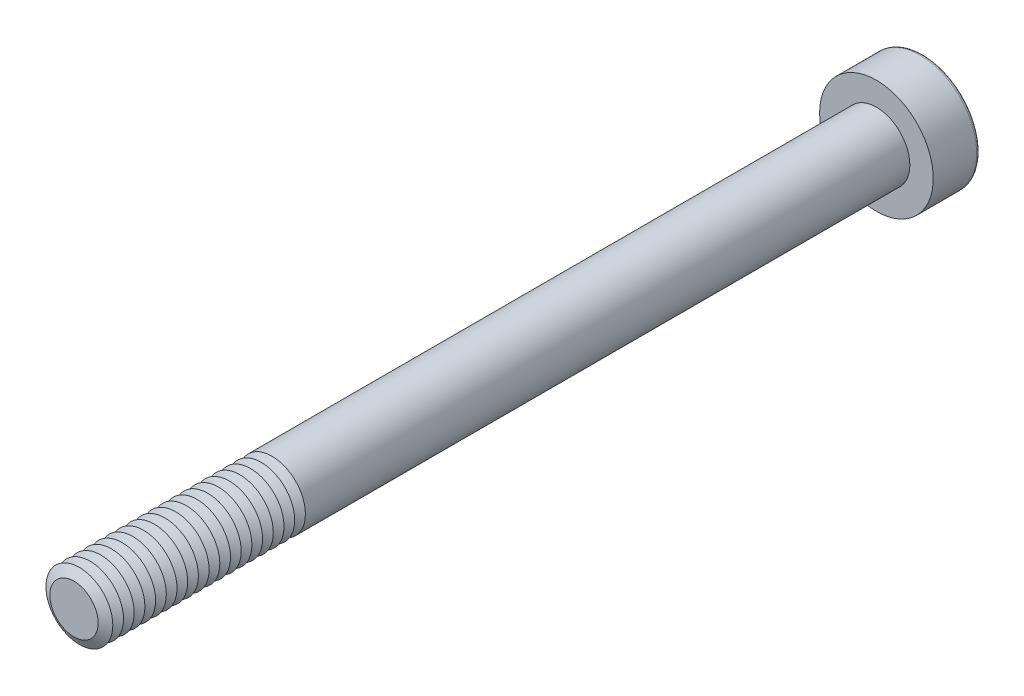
ISO-10303-21;
HEADER;
FILE_DESCRIPTION(('STEP AP214'),'2;1');
FILE_NAME('part.step','',(''),(''),'','','');
FILE_SCHEMA(('AUTOMOTIVE_DESIGN { 1 0 10303 214 1 1 1 1 }'));
ENDSEC;
DATA;
#1=APPLICATION_CONTEXT('core data for automotive mechanical design processes');
#2=APPLICATION_PROTOCOL_DEFINITION('international standard','automotive_design',2000,#1);
#3=PRODUCT_CONTEXT('',#1,'mechanical');
#4=PRODUCT('Part','Part','',(#3));
#5=PRODUCT_RELATED_PRODUCT_CATEGORY('part','',(#4));
#6=PRODUCT_DEFINITION_FORMATION('','',#4);
#7=PRODUCT_DEFINITION_CONTEXT('part definition',#1,'design');
#8=PRODUCT_DEFINITION('design','',#6,#7);
#9=PRODUCT_DEFINITION_SHAPE('','',#8);
#10=(LENGTH_UNIT() NAMED_UNIT(*) SI_UNIT(.MILLI.,.METRE.));
#11=(NAMED_UNIT(*) PLANE_ANGLE_UNIT() SI_UNIT($,.RADIAN.));
#12=(NAMED_UNIT(*) SI_UNIT($,.STERADIAN.) SOLID_ANGLE_UNIT());
#13=UNCERTAINTY_MEASURE_WITH_UNIT(LENGTH_MEASURE(1.E-05),#10,'distance_accuracy_value','');
#14=(GEOMETRIC_REPRESENTATION_CONTEXT(3) GLOBAL_UNCERTAINTY_ASSIGNED_CONTEXT((#13)) GLOBAL_UNIT_ASSIGNED_CONTEXT((#10,
#11,#12)) REPRESENTATION_CONTEXT('',''));
#15=CARTESIAN_POINT('',(0.,0.,0.));
#16=DIRECTION('',(0.,0.,1.));
#17=DIRECTION('',(1.,0.,0.));
#18=AXIS2_PLACEMENT_3D('',#15,#16,#17);
#19=CARTESIAN_POINT('',(0.,0.,57.2));
#20=DIRECTION('',(0.,0.,1.));
#21=DIRECTION('',(1.,0.,0.));
#22=AXIS2_PLACEMENT_3D('',#19,#20,#21);
#23=CONICAL_SURFACE('',#22,2.5,1.0471975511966);
#24=CARTESIAN_POINT('',(0.,0.,56.8));
#25=DIRECTION('',(0.,0.,1.));
#26=DIRECTION('',(1.,0.,0.));
#27=AXIS2_PLACEMENT_3D('',#24,#25,#26);
#28=CIRCLE('',#27,1.80717967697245);
#29=CARTESIAN_POINT('',(1.80717967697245,0.,56.8));
#30=VERTEX_POINT('',#29);
#31=EDGE_CURVE('E312',#30,#30,#28,.T.);
#32=ORIENTED_EDGE('',*,*,#31,.T.);
#33=EDGE_LOOP('',(#32));
#34=FACE_BOUND('',#33,.T.);
#35=CARTESIAN_POINT('',(0.,0.,57.2));
#36=DIRECTION('',(0.,0.,1.));
#37=DIRECTION('',(1.,0.,0.));
#38=AXIS2_PLACEMENT_3D('',#35,#36,#37);
#39=CIRCLE('',#38,2.5);
#40=CARTESIAN_POINT('',(2.5,0.,57.2));
#41=VERTEX_POINT('',#40);
#42=EDGE_CURVE('E315',#41,#41,#39,.T.);
#43=ORIENTED_EDGE('',*,*,#42,.F.);
#44=EDGE_LOOP('',(#43));
#45=FACE_BOUND('',#44,.T.);
#46=ADVANCED_FACE('F39',(#34,#45),#23,.T.);
#47=CARTESIAN_POINT('',(0.,0.,56.8));
#48=DIRECTION('',(0.,0.,-1.));
#49=DIRECTION('',(-1.,0.,0.));
#50=AXIS2_PLACEMENT_3D('',#47,#48,#49);
#51=CONICAL_SURFACE('',#50,1.80717967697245,1.04719755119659);
#52=CARTESIAN_POINT('',(0.,0.,56.4));
#53=DIRECTION('',(0.,0.,1.));
#54=DIRECTION('',(1.,0.,0.));
#55=AXIS2_PLACEMENT_3D('',#52,#53,#54);
#56=CIRCLE('',#55,2.5);
#57=CARTESIAN_POINT('',(2.5,0.,56.4));
#58=VERTEX_POINT('',#57);
#59=EDGE_CURVE('E323',#58,#58,#56,.T.);
#60=ORIENTED_EDGE('',*,*,#59,.T.);
#61=EDGE_LOOP('',(#60));
#62=FACE_BOUND('',#61,.T.);
#63=ORIENTED_EDGE('',*,*,#31,.F.);
#64=EDGE_LOOP('',(#63));
#65=FACE_BOUND('',#64,.T.);
#66=ADVANCED_FACE('F244',(#62,#65),#51,.T.);
#67=CARTESIAN_POINT('',(0.,0.,60.));
#68=DIRECTION('',(0.,0.,1.));
#69=DIRECTION('',(1.,0.,0.));
#70=AXIS2_PLACEMENT_3D('',#67,#68,#69);
#71=PLANE('',#70);
#72=CARTESIAN_POINT('',(0.,0.,60.));
#73=DIRECTION('',(0.,0.,1.));
#74=DIRECTION('',(1.,0.,0.));
#75=AXIS2_PLACEMENT_3D('',#72,#73,#74);
#76=CIRCLE('',#75,1.80717967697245);
#77=CARTESIAN_POINT('',(1.80717967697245,0.,60.));
#78=VERTEX_POINT('',#77);
#79=EDGE_CURVE('E174',#78,#78,#76,.T.);
#80=ORIENTED_EDGE('',*,*,#79,.T.);
#81=EDGE_LOOP('',(#80));
#82=FACE_BOUND('',#81,.T.);
#83=ADVANCED_FACE('F250',(#82),#71,.T.);
#84=CARTESIAN_POINT('',(0.,0.,60.));
#85=DIRECTION('',(0.,0.,-1.));
#86=DIRECTION('',(-1.,0.,0.));
#87=AXIS2_PLACEMENT_3D('',#84,#85,#86);
#88=CONICAL_SURFACE('',#87,1.80717967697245,1.04719755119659);
#89=CARTESIAN_POINT('',(0.,0.,59.6));
#90=DIRECTION('',(0.,0.,1.));
#91=DIRECTION('',(1.,0.,0.));
#92=AXIS2_PLACEMENT_3D('',#89,#90,#91);
#93=CIRCLE('',#92,2.5);
#94=CARTESIAN_POINT('',(2.5,0.,59.6));
#95=VERTEX_POINT('',#94);
#96=EDGE_CURVE('E290',#95,#95,#93,.T.);
#97=ORIENTED_EDGE('',*,*,#96,.T.);
#98=EDGE_LOOP('',(#97));
#99=FACE_BOUND('',#98,.T.);
#100=ORIENTED_EDGE('',*,*,#79,.F.);
#101=EDGE_LOOP('',(#100));
#102=FACE_BOUND('',#101,.T.);
#103=ADVANCED_FACE('F198',(#99,#102),#88,.T.);
#104=CARTESIAN_POINT('',(0.,0.,59.6));
#105=DIRECTION('',(0.,0.,1.));
#106=DIRECTION('',(1.,0.,0.));
#107=AXIS2_PLACEMENT_3D('',#104,#105,#106);
#108=CONICAL_SURFACE('',#107,2.5,1.0471975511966);
#109=CARTESIAN_POINT('',(0.,0.,59.2));
#110=DIRECTION('',(0.,0.,1.));
#111=DIRECTION('',(1.,0.,0.));
#112=AXIS2_PLACEMENT_3D('',#109,#110,#111);
#113=CIRCLE('',#112,1.80717967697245);
#114=CARTESIAN_POINT('',(1.80717967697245,0.,59.2));
#115=VERTEX_POINT('',#114);
#116=EDGE_CURVE('E287',#115,#115,#113,.T.);
#117=ORIENTED_EDGE('',*,*,#116,.T.);
#118=EDGE_LOOP('',(#117));
#119=FACE_BOUND('',#118,.T.);
#120=ORIENTED_EDGE('',*,*,#96,.F.);
#121=EDGE_LOOP('',(#120));
#122=FACE_BOUND('',#121,.T.);
#123=ADVANCED_FACE('F276',(#119,#122),#108,.T.);
#124=CARTESIAN_POINT('',(0.,0.,59.2));
#125=DIRECTION('',(0.,0.,-1.));
#126=DIRECTION('',(-1.,0.,0.));
#127=AXIS2_PLACEMENT_3D('',#124,#125,#126);
#128=CONICAL_SURFACE('',#127,1.80717967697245,1.04719755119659);
#129=CARTESIAN_POINT('',(0.,0.,58.8));
#130=DIRECTION('',(0.,0.,1.));
#131=DIRECTION('',(1.,0.,0.));
#132=AXIS2_PLACEMENT_3D('',#129,#130,#131);
#133=CIRCLE('',#132,2.5);
#134=CARTESIAN_POINT('',(2.5,0.,58.8));
#135=VERTEX_POINT('',#134);
#136=EDGE_CURVE('E298',#135,#135,#133,.T.);
#137=ORIENTED_EDGE('',*,*,#136,.T.);
#138=EDGE_LOOP('',(#137));
#139=FACE_BOUND('',#138,.T.);
#140=ORIENTED_EDGE('',*,*,#116,.F.);
#141=EDGE_LOOP('',(#140));
#142=FACE_BOUND('',#141,.T.);
#143=ADVANCED_FACE('F273',(#139,#142),#128,.T.);
#144=CARTESIAN_POINT('',(0.,0.,58.8));
#145=DIRECTION('',(0.,0.,1.));
#146=DIRECTION('',(1.,0.,0.));
#147=AXIS2_PLACEMENT_3D('',#144,#145,#146);
#148=CONICAL_SURFACE('',#147,2.5,1.0471975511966);
#149=CARTESIAN_POINT('',(0.,0.,58.4));
#150=DIRECTION('',(0.,0.,1.));
#151=DIRECTION('',(1.,0.,0.));
#152=AXIS2_PLACEMENT_3D('',#149,#150,#151);
#153=CIRCLE('',#152,1.80717967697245);
#154=CARTESIAN_POINT('',(1.80717967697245,0.,58.4));
#155=VERTEX_POINT('',#154);
#156=EDGE_CURVE('E292',#155,#155,#153,.T.);
#157=ORIENTED_EDGE('',*,*,#156,.T.);
#158=EDGE_LOOP('',(#157));
#159=FACE_BOUND('',#158,.T.);
#160=ORIENTED_EDGE('',*,*,#136,.F.);
#161=EDGE_LOOP('',(#160));
#162=FACE_BOUND('',#161,.T.);
#163=ADVANCED_FACE('F269',(#159,#162),#148,.T.);
#164=CARTESIAN_POINT('',(0.,0.,58.4));
#165=DIRECTION('',(0.,0.,-1.));
#166=DIRECTION('',(-1.,0.,0.));
#167=AXIS2_PLACEMENT_3D('',#164,#165,#166);
#168=CONICAL_SURFACE('',#167,1.80717967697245,1.04719755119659);
#169=CARTESIAN_POINT('',(0.,0.,58.));
#170=DIRECTION('',(0.,0.,1.));
#171=DIRECTION('',(1.,0.,0.));
#172=AXIS2_PLACEMENT_3D('',#169,#170,#171);
#173=CIRCLE('',#172,2.5);
#174=CARTESIAN_POINT('',(2.5,0.,58.));
#175=VERTEX_POINT('',#174);
#176=EDGE_CURVE('E308',#175,#175,#173,.T.);
#177=ORIENTED_EDGE('',*,*,#176,.T.);
#178=EDGE_LOOP('',(#177));
#179=FACE_BOUND('',#178,.T.);
#180=ORIENTED_EDGE('',*,*,#156,.F.);
#181=EDGE_LOOP('',(#180));
#182=FACE_BOUND('',#181,.T.);
#183=ADVANCED_FACE('F265',(#179,#182),#168,.T.);
#184=CARTESIAN_POINT('',(0.,0.,58.));
#185=DIRECTION('',(0.,0.,1.));
#186=DIRECTION('',(1.,0.,0.));
#187=AXIS2_PLACEMENT_3D('',#184,#185,#186);
#188=CONICAL_SURFACE('',#187,2.5,1.0471975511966);
#189=CARTESIAN_POINT('',(0.,0.,57.6));
#190=DIRECTION('',(0.,0.,1.));
#191=DIRECTION('',(1.,0.,0.));
#192=AXIS2_PLACEMENT_3D('',#189,#190,#191);
#193=CIRCLE('',#192,1.80717967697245);
#194=CARTESIAN_POINT('',(1.80717967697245,0.,57.6));
#195=VERTEX_POINT('',#194);
#196=EDGE_CURVE('E304',#195,#195,#193,.T.);
#197=ORIENTED_EDGE('',*,*,#196,.T.);
#198=EDGE_LOOP('',(#197));
#199=FACE_BOUND('',#198,.T.);
#200=ORIENTED_EDGE('',*,*,#176,.F.);
#201=EDGE_LOOP('',(#200));
#202=FACE_BOUND('',#201,.T.);
#203=ADVANCED_FACE('F261',(#199,#202),#188,.T.);
#204=CARTESIAN_POINT('',(0.,0.,57.6));
#205=DIRECTION('',(0.,0.,-1.));
#206=DIRECTION('',(-1.,0.,0.));
#207=AXIS2_PLACEMENT_3D('',#204,#205,#206);
#208=CONICAL_SURFACE('',#207,1.80717967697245,1.04719755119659);
#209=ORIENTED_EDGE('',*,*,#42,.T.);
#210=EDGE_LOOP('',(#209));
#211=FACE_BOUND('',#210,.T.);
#212=ORIENTED_EDGE('',*,*,#196,.F.);
#213=EDGE_LOOP('',(#212));
#214=FACE_BOUND('',#213,.T.);
#215=ADVANCED_FACE('F257',(#211,#214),#208,.T.);
#216=CARTESIAN_POINT('',(0.,0.,56.4));
#217=DIRECTION('',(0.,0.,1.));
#218=DIRECTION('',(1.,0.,0.));
#219=AXIS2_PLACEMENT_3D('',#216,#217,#218);
#220=CONICAL_SURFACE('',#219,2.5,1.0471975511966);
#221=CARTESIAN_POINT('',(0.,0.,56.));
#222=DIRECTION('',(0.,0.,1.));
#223=DIRECTION('',(1.,0.,0.));
#224=AXIS2_PLACEMENT_3D('',#221,#222,#223);
#225=CIRCLE('',#224,1.80717967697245);
#226=CARTESIAN_POINT('',(1.80717967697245,0.,56.));
#227=VERTEX_POINT('',#226);
#228=EDGE_CURVE('E319',#227,#227,#225,.T.);
#229=ORIENTED_EDGE('',*,*,#228,.T.);
#230=EDGE_LOOP('',(#229));
#231=FACE_BOUND('',#230,.T.);
#232=ORIENTED_EDGE('',*,*,#59,.F.);
#233=EDGE_LOOP('',(#232));
#234=FACE_BOUND('',#233,.T.);
#235=ADVANCED_FACE('F260',(#231,#234),#220,.T.);
#236=CARTESIAN_POINT('',(0.,0.,56.));
#237=DIRECTION('',(0.,0.,-1.));
#238=DIRECTION('',(-1.,0.,0.));
#239=AXIS2_PLACEMENT_3D('',#236,#237,#238);
#240=CONICAL_SURFACE('',#239,1.80717967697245,1.04719755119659);
#241=CARTESIAN_POINT('',(0.,0.,55.6));
#242=DIRECTION('',(0.,0.,1.));
#243=DIRECTION('',(1.,0.,0.));
#244=AXIS2_PLACEMENT_3D('',#241,#242,#243);
#245=CIRCLE('',#244,2.5);
#246=CARTESIAN_POINT('',(2.5,0.,55.6));
#247=VERTEX_POINT('',#246);
#248=EDGE_CURVE('E330',#247,#247,#245,.T.);
#249=ORIENTED_EDGE('',*,*,#248,.T.);
#250=EDGE_LOOP('',(#249));
#251=FACE_BOUND('',#250,.T.);
#252=ORIENTED_EDGE('',*,*,#228,.F.);
#253=EDGE_LOOP('',(#252));
#254=FACE_BOUND('',#253,.T.);
#255=ADVANCED_FACE('F541',(#251,#254),#240,.T.);
#256=CARTESIAN_POINT('',(0.,0.,55.6));
#257=DIRECTION('',(0.,0.,1.));
#258=DIRECTION('',(1.,0.,0.));
#259=AXIS2_PLACEMENT_3D('',#256,#257,#258);
#260=CONICAL_SURFACE('',#259,2.5,1.0471975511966);
#261=CARTESIAN_POINT('',(0.,0.,55.2));
#262=DIRECTION('',(0.,0.,1.));
#263=DIRECTION('',(1.,0.,0.));
#264=AXIS2_PLACEMENT_3D('',#261,#262,#263);
#265=CIRCLE('',#264,1.80717967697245);
#266=CARTESIAN_POINT('',(1.80717967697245,0.,55.2));
#267=VERTEX_POINT('',#266);
#268=EDGE_CURVE('E326',#267,#267,#265,.T.);
#269=ORIENTED_EDGE('',*,*,#268,.T.);
#270=EDGE_LOOP('',(#269));
#271=FACE_BOUND('',#270,.T.);
#272=ORIENTED_EDGE('',*,*,#248,.F.);
#273=EDGE_LOOP('',(#272));
#274=FACE_BOUND('',#273,.T.);
#275=ADVANCED_FACE('F537',(#271,#274),#260,.T.);
#276=CARTESIAN_POINT('',(0.,0.,55.2));
#277=DIRECTION('',(0.,0.,-1.));
#278=DIRECTION('',(-1.,0.,0.));
#279=AXIS2_PLACEMENT_3D('',#276,#277,#278);
#280=CONICAL_SURFACE('',#279,1.80717967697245,1.04719755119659);
#281=CARTESIAN_POINT('',(0.,0.,54.8));
#282=DIRECTION('',(0.,0.,1.));
#283=DIRECTION('',(1.,0.,0.));
#284=AXIS2_PLACEMENT_3D('',#281,#282,#283);
#285=CIRCLE('',#284,2.5);
#286=CARTESIAN_POINT('',(2.5,0.,54.8));
#287=VERTEX_POINT('',#286);
#288=EDGE_CURVE('E338',#287,#287,#285,.T.);
#289=ORIENTED_EDGE('',*,*,#288,.T.);
#290=EDGE_LOOP('',(#289));
#291=FACE_BOUND('',#290,.T.);
#292=ORIENTED_EDGE('',*,*,#268,.F.);
#293=EDGE_LOOP('',(#292));
#294=FACE_BOUND('',#293,.T.);
#295=ADVANCED_FACE('F533',(#291,#294),#280,.T.);
#296=CARTESIAN_POINT('',(0.,0.,54.8));
#297=DIRECTION('',(0.,0.,1.));
#298=DIRECTION('',(1.,0.,0.));
#299=AXIS2_PLACEMENT_3D('',#296,#297,#298);
#300=CONICAL_SURFACE('',#299,2.5,1.0471975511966);
#301=CARTESIAN_POINT('',(0.,0.,54.4));
#302=DIRECTION('',(0.,0.,1.));
#303=DIRECTION('',(1.,0.,0.));
#304=AXIS2_PLACEMENT_3D('',#301,#302,#303);
#305=CIRCLE('',#304,1.80717967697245);
#306=CARTESIAN_POINT('',(1.80717967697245,0.,54.4));
#307=VERTEX_POINT('',#306);
#308=EDGE_CURVE('E334',#307,#307,#305,.T.);
#309=ORIENTED_EDGE('',*,*,#308,.T.);
#310=EDGE_LOOP('',(#309));
#311=FACE_BOUND('',#310,.T.);
#312=ORIENTED_EDGE('',*,*,#288,.F.);
#313=EDGE_LOOP('',(#312));
#314=FACE_BOUND('',#313,.T.);
#315=ADVANCED_FACE('F529',(#311,#314),#300,.T.);
#316=CARTESIAN_POINT('',(0.,0.,54.4));
#317=DIRECTION('',(0.,0.,-1.));
#318=DIRECTION('',(-1.,0.,0.));
#319=AXIS2_PLACEMENT_3D('',#316,#317,#318);
#320=CONICAL_SURFACE('',#319,1.80717967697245,1.04719755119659);
#321=CARTESIAN_POINT('',(0.,0.,54.));
#322=DIRECTION('',(0.,0.,1.));
#323=DIRECTION('',(1.,0.,0.));
#324=AXIS2_PLACEMENT_3D('',#321,#322,#323);
#325=CIRCLE('',#324,2.5);
#326=CARTESIAN_POINT('',(2.5,0.,54.));
#327=VERTEX_POINT('',#326);
#328=EDGE_CURVE('E346',#327,#327,#325,.T.);
#329=ORIENTED_EDGE('',*,*,#328,.T.);
#330=EDGE_LOOP('',(#329));
#331=FACE_BOUND('',#330,.T.);
#332=ORIENTED_EDGE('',*,*,#308,.F.);
#333=EDGE_LOOP('',(#332));
#334=FACE_BOUND('',#333,.T.);
#335=ADVANCED_FACE('F525',(#331,#334),#320,.T.);
#336=CARTESIAN_POINT('',(0.,0.,54.));
#337=DIRECTION('',(0.,0.,1.));
#338=DIRECTION('',(1.,0.,0.));
#339=AXIS2_PLACEMENT_3D('',#336,#337,#338);
#340=CONICAL_SURFACE('',#339,2.5,1.0471975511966);
#341=CARTESIAN_POINT('',(0.,0.,53.6));
#342=DIRECTION('',(0.,0.,1.));
#343=DIRECTION('',(1.,0.,0.));
#344=AXIS2_PLACEMENT_3D('',#341,#342,#343);
#345=CIRCLE('',#344,1.80717967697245);
#346=CARTESIAN_POINT('',(1.80717967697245,0.,53.6));
#347=VERTEX_POINT('',#346);
#348=EDGE_CURVE('E342',#347,#347,#345,.T.);
#349=ORIENTED_EDGE('',*,*,#348,.T.);
#350=EDGE_LOOP('',(#349));
#351=FACE_BOUND('',#350,.T.);
#352=ORIENTED_EDGE('',*,*,#328,.F.);
#353=EDGE_LOOP('',(#352));
#354=FACE_BOUND('',#353,.T.);
#355=ADVANCED_FACE('F521',(#351,#354),#340,.T.);
#356=CARTESIAN_POINT('',(0.,0.,53.6));
#357=DIRECTION('',(0.,0.,-1.));
#358=DIRECTION('',(-1.,0.,0.));
#359=AXIS2_PLACEMENT_3D('',#356,#357,#358);
#360=CONICAL_SURFACE('',#359,1.80717967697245,1.04719755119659);
#361=CARTESIAN_POINT('',(0.,0.,53.2));
#362=DIRECTION('',(0.,0.,1.));
#363=DIRECTION('',(1.,0.,0.));
#364=AXIS2_PLACEMENT_3D('',#361,#362,#363);
#365=CIRCLE('',#364,2.5);
#366=CARTESIAN_POINT('',(2.5,0.,53.2));
#367=VERTEX_POINT('',#366);
#368=EDGE_CURVE('E354',#367,#367,#365,.T.);
#369=ORIENTED_EDGE('',*,*,#368,.T.);
#370=EDGE_LOOP('',(#369));
#371=FACE_BOUND('',#370,.T.);
#372=ORIENTED_EDGE('',*,*,#348,.F.);
#373=EDGE_LOOP('',(#372));
#374=FACE_BOUND('',#373,.T.);
#375=ADVANCED_FACE('F517',(#371,#374),#360,.T.);
#376=CARTESIAN_POINT('',(0.,0.,53.2));
#377=DIRECTION('',(0.,0.,1.));
#378=DIRECTION('',(1.,0.,0.));
#379=AXIS2_PLACEMENT_3D('',#376,#377,#378);
#380=CONICAL_SURFACE('',#379,2.5,1.0471975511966);
#381=CARTESIAN_POINT('',(0.,0.,52.8));
#382=DIRECTION('',(0.,0.,1.));
#383=DIRECTION('',(1.,0.,0.));
#384=AXIS2_PLACEMENT_3D('',#381,#382,#383);
#385=CIRCLE('',#384,1.80717967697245);
#386=CARTESIAN_POINT('',(1.80717967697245,0.,52.8));
#387=VERTEX_POINT('',#386);
#388=EDGE_CURVE('E350',#387,#387,#385,.T.);
#389=ORIENTED_EDGE('',*,*,#388,.T.);
#390=EDGE_LOOP('',(#389));
#391=FACE_BOUND('',#390,.T.);
#392=ORIENTED_EDGE('',*,*,#368,.F.);
#393=EDGE_LOOP('',(#392));
#394=FACE_BOUND('',#393,.T.);
#395=ADVANCED_FACE('F513',(#391,#394),#380,.T.);
#396=CARTESIAN_POINT('',(0.,0.,52.8));
#397=DIRECTION('',(0.,0.,-1.));
#398=DIRECTION('',(-1.,0.,0.));
#399=AXIS2_PLACEMENT_3D('',#396,#397,#398);
#400=CONICAL_SURFACE('',#399,1.80717967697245,1.04719755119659);
#401=CARTESIAN_POINT('',(0.,0.,52.4));
#402=DIRECTION('',(0.,0.,1.));
#403=DIRECTION('',(1.,0.,0.));
#404=AXIS2_PLACEMENT_3D('',#401,#402,#403);
#405=CIRCLE('',#404,2.5);
#406=CARTESIAN_POINT('',(2.5,0.,52.4));
#407=VERTEX_POINT('',#406);
#408=EDGE_CURVE('E362',#407,#407,#405,.T.);
#409=ORIENTED_EDGE('',*,*,#408,.T.);
#410=EDGE_LOOP('',(#409));
#411=FACE_BOUND('',#410,.T.);
#412=ORIENTED_EDGE('',*,*,#388,.F.);
#413=EDGE_LOOP('',(#412));
#414=FACE_BOUND('',#413,.T.);
#415=ADVANCED_FACE('F509',(#411,#414),#400,.T.);
#416=CARTESIAN_POINT('',(0.,0.,52.4));
#417=DIRECTION('',(0.,0.,1.));
#418=DIRECTION('',(1.,0.,0.));
#419=AXIS2_PLACEMENT_3D('',#416,#417,#418);
#420=CONICAL_SURFACE('',#419,2.5,1.0471975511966);
#421=CARTESIAN_POINT('',(0.,0.,52.));
#422=DIRECTION('',(0.,0.,1.));
#423=DIRECTION('',(1.,0.,0.));
#424=AXIS2_PLACEMENT_3D('',#421,#422,#423);
#425=CIRCLE('',#424,1.80717967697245);
#426=CARTESIAN_POINT('',(1.80717967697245,0.,52.));
#427=VERTEX_POINT('',#426);
#428=EDGE_CURVE('E358',#427,#427,#425,.T.);
#429=ORIENTED_EDGE('',*,*,#428,.T.);
#430=EDGE_LOOP('',(#429));
#431=FACE_BOUND('',#430,.T.);
#432=ORIENTED_EDGE('',*,*,#408,.F.);
#433=EDGE_LOOP('',(#432));
#434=FACE_BOUND('',#433,.T.);
#435=ADVANCED_FACE('F505',(#431,#434),#420,.T.);
#436=CARTESIAN_POINT('',(0.,0.,52.));
#437=DIRECTION('',(0.,0.,-1.));
#438=DIRECTION('',(-1.,0.,0.));
#439=AXIS2_PLACEMENT_3D('',#436,#437,#438);
#440=CONICAL_SURFACE('',#439,1.80717967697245,1.04719755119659);
#441=CARTESIAN_POINT('',(0.,0.,51.6));
#442=DIRECTION('',(0.,0.,1.));
#443=DIRECTION('',(1.,0.,0.));
#444=AXIS2_PLACEMENT_3D('',#441,#442,#443);
#445=CIRCLE('',#444,2.5);
#446=CARTESIAN_POINT('',(2.5,0.,51.6));
#447=VERTEX_POINT('',#446);
#448=EDGE_CURVE('E370',#447,#447,#445,.T.);
#449=ORIENTED_EDGE('',*,*,#448,.T.);
#450=EDGE_LOOP('',(#449));
#451=FACE_BOUND('',#450,.T.);
#452=ORIENTED_EDGE('',*,*,#428,.F.);
#453=EDGE_LOOP('',(#452));
#454=FACE_BOUND('',#453,.T.);
#455=ADVANCED_FACE('F501',(#451,#454),#440,.T.);
#456=CARTESIAN_POINT('',(0.,0.,51.6));
#457=DIRECTION('',(0.,0.,1.));
#458=DIRECTION('',(1.,0.,0.));
#459=AXIS2_PLACEMENT_3D('',#456,#457,#458);
#460=CONICAL_SURFACE('',#459,2.5,1.0471975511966);
#461=CARTESIAN_POINT('',(0.,0.,51.2));
#462=DIRECTION('',(0.,0.,1.));
#463=DIRECTION('',(1.,0.,0.));
#464=AXIS2_PLACEMENT_3D('',#461,#462,#463);
#465=CIRCLE('',#464,1.80717967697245);
#466=CARTESIAN_POINT('',(1.80717967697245,0.,51.2));
#467=VERTEX_POINT('',#466);
#468=EDGE_CURVE('E366',#467,#467,#465,.T.);
#469=ORIENTED_EDGE('',*,*,#468,.T.);
#470=EDGE_LOOP('',(#469));
#471=FACE_BOUND('',#470,.T.);
#472=ORIENTED_EDGE('',*,*,#448,.F.);
#473=EDGE_LOOP('',(#472));
#474=FACE_BOUND('',#473,.T.);
#475=ADVANCED_FACE('F497',(#471,#474),#460,.T.);
#476=CARTESIAN_POINT('',(0.,0.,51.2));
#477=DIRECTION('',(0.,0.,-1.));
#478=DIRECTION('',(-1.,0.,0.));
#479=AXIS2_PLACEMENT_3D('',#476,#477,#478);
#480=CONICAL_SURFACE('',#479,1.80717967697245,1.04719755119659);
#481=CARTESIAN_POINT('',(0.,0.,50.8));
#482=DIRECTION('',(0.,0.,1.));
#483=DIRECTION('',(1.,0.,0.));
#484=AXIS2_PLACEMENT_3D('',#481,#482,#483);
#485=CIRCLE('',#484,2.5);
#486=CARTESIAN_POINT('',(2.5,0.,50.8));
#487=VERTEX_POINT('',#486);
#488=EDGE_CURVE('E377',#487,#487,#485,.T.);
#489=ORIENTED_EDGE('',*,*,#488,.T.);
#490=EDGE_LOOP('',(#489));
#491=FACE_BOUND('',#490,.T.);
#492=ORIENTED_EDGE('',*,*,#468,.F.);
#493=EDGE_LOOP('',(#492));
#494=FACE_BOUND('',#493,.T.);
#495=ADVANCED_FACE('F493',(#491,#494),#480,.T.);
#496=CARTESIAN_POINT('',(0.,0.,50.8));
#497=DIRECTION('',(0.,0.,1.));
#498=DIRECTION('',(1.,0.,0.));
#499=AXIS2_PLACEMENT_3D('',#496,#497,#498);
#500=CONICAL_SURFACE('',#499,2.5,1.0471975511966);
#501=CARTESIAN_POINT('',(0.,0.,50.4));
#502=DIRECTION('',(0.,0.,1.));
#503=DIRECTION('',(1.,0.,0.));
#504=AXIS2_PLACEMENT_3D('',#501,#502,#503);
#505=CIRCLE('',#504,1.80717967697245);
#506=CARTESIAN_POINT('',(1.80717967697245,0.,50.4));
#507=VERTEX_POINT('',#506);
#508=EDGE_CURVE('E373',#507,#507,#505,.T.);
#509=ORIENTED_EDGE('',*,*,#508,.T.);
#510=EDGE_LOOP('',(#509));
#511=FACE_BOUND('',#510,.T.);
#512=ORIENTED_EDGE('',*,*,#488,.F.);
#513=EDGE_LOOP('',(#512));
#514=FACE_BOUND('',#513,.T.);
#515=ADVANCED_FACE('F489',(#511,#514),#500,.T.);
#516=CARTESIAN_POINT('',(0.,0.,50.4));
#517=DIRECTION('',(0.,0.,-1.));
#518=DIRECTION('',(-1.,0.,0.));
#519=AXIS2_PLACEMENT_3D('',#516,#517,#518);
#520=CONICAL_SURFACE('',#519,1.80717967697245,1.04719755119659);
#521=CARTESIAN_POINT('',(0.,0.,50.));
#522=DIRECTION('',(0.,0.,1.));
#523=DIRECTION('',(1.,0.,0.));
#524=AXIS2_PLACEMENT_3D('',#521,#522,#523);
#525=CIRCLE('',#524,2.5);
#526=CARTESIAN_POINT('',(2.5,0.,50.));
#527=VERTEX_POINT('',#526);
#528=EDGE_CURVE('E385',#527,#527,#525,.T.);
#529=ORIENTED_EDGE('',*,*,#528,.T.);
#530=EDGE_LOOP('',(#529));
#531=FACE_BOUND('',#530,.T.);
#532=ORIENTED_EDGE('',*,*,#508,.F.);
#533=EDGE_LOOP('',(#532));
#534=FACE_BOUND('',#533,.T.);
#535=ADVANCED_FACE('F485',(#531,#534),#520,.T.);
#536=CARTESIAN_POINT('',(0.,0.,50.));
#537=DIRECTION('',(0.,0.,1.));
#538=DIRECTION('',(1.,0.,0.));
#539=AXIS2_PLACEMENT_3D('',#536,#537,#538);
#540=CONICAL_SURFACE('',#539,2.5,1.0471975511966);
#541=CARTESIAN_POINT('',(0.,0.,49.6));
#542=DIRECTION('',(0.,0.,1.));
#543=DIRECTION('',(1.,0.,0.));
#544=AXIS2_PLACEMENT_3D('',#541,#542,#543);
#545=CIRCLE('',#544,1.80717967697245);
#546=CARTESIAN_POINT('',(1.80717967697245,0.,49.6));
#547=VERTEX_POINT('',#546);
#548=EDGE_CURVE('E381',#547,#547,#545,.T.);
#549=ORIENTED_EDGE('',*,*,#548,.T.);
#550=EDGE_LOOP('',(#549));
#551=FACE_BOUND('',#550,.T.);
#552=ORIENTED_EDGE('',*,*,#528,.F.);
#553=EDGE_LOOP('',(#552));
#554=FACE_BOUND('',#553,.T.);
#555=ADVANCED_FACE('F481',(#551,#554),#540,.T.);
#556=CARTESIAN_POINT('',(0.,0.,49.6));
#557=DIRECTION('',(0.,0.,-1.));
#558=DIRECTION('',(-1.,0.,0.));
#559=AXIS2_PLACEMENT_3D('',#556,#557,#558);
#560=CONICAL_SURFACE('',#559,1.80717967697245,1.04719755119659);
#561=CARTESIAN_POINT('',(0.,0.,49.2));
#562=DIRECTION('',(0.,0.,1.));
#563=DIRECTION('',(1.,0.,0.));
#564=AXIS2_PLACEMENT_3D('',#561,#562,#563);
#565=CIRCLE('',#564,2.5);
#566=CARTESIAN_POINT('',(2.5,0.,49.2));
#567=VERTEX_POINT('',#566);
#568=EDGE_CURVE('E393',#567,#567,#565,.T.);
#569=ORIENTED_EDGE('',*,*,#568,.T.);
#570=EDGE_LOOP('',(#569));
#571=FACE_BOUND('',#570,.T.);
#572=ORIENTED_EDGE('',*,*,#548,.F.);
#573=EDGE_LOOP('',(#572));
#574=FACE_BOUND('',#573,.T.);
#575=ADVANCED_FACE('F477',(#571,#574),#560,.T.);
#576=CARTESIAN_POINT('',(0.,0.,49.2));
#577=DIRECTION('',(0.,0.,1.));
#578=DIRECTION('',(1.,0.,0.));
#579=AXIS2_PLACEMENT_3D('',#576,#577,#578);
#580=CONICAL_SURFACE('',#579,2.5,1.0471975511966);
#581=CARTESIAN_POINT('',(0.,0.,48.8));
#582=DIRECTION('',(0.,0.,1.));
#583=DIRECTION('',(1.,0.,0.));
#584=AXIS2_PLACEMENT_3D('',#581,#582,#583);
#585=CIRCLE('',#584,1.80717967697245);
#586=CARTESIAN_POINT('',(1.80717967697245,0.,48.8));
#587=VERTEX_POINT('',#586);
#588=EDGE_CURVE('E389',#587,#587,#585,.T.);
#589=ORIENTED_EDGE('',*,*,#588,.T.);
#590=EDGE_LOOP('',(#589));
#591=FACE_BOUND('',#590,.T.);
#592=ORIENTED_EDGE('',*,*,#568,.F.);
#593=EDGE_LOOP('',(#592));
#594=FACE_BOUND('',#593,.T.);
#595=ADVANCED_FACE('F473',(#591,#594),#580,.T.);
#596=CARTESIAN_POINT('',(0.,0.,48.8));
#597=DIRECTION('',(0.,0.,-1.));
#598=DIRECTION('',(-1.,0.,0.));
#599=AXIS2_PLACEMENT_3D('',#596,#597,#598);
#600=CONICAL_SURFACE('',#599,1.80717967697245,1.04719755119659);
#601=CARTESIAN_POINT('',(0.,0.,48.4));
#602=DIRECTION('',(0.,0.,1.));
#603=DIRECTION('',(1.,0.,0.));
#604=AXIS2_PLACEMENT_3D('',#601,#602,#603);
#605=CIRCLE('',#604,2.5);
#606=CARTESIAN_POINT('',(2.5,0.,48.4));
#607=VERTEX_POINT('',#606);
#608=EDGE_CURVE('E401',#607,#607,#605,.T.);
#609=ORIENTED_EDGE('',*,*,#608,.T.);
#610=EDGE_LOOP('',(#609));
#611=FACE_BOUND('',#610,.T.);
#612=ORIENTED_EDGE('',*,*,#588,.F.);
#613=EDGE_LOOP('',(#612));
#614=FACE_BOUND('',#613,.T.);
#615=ADVANCED_FACE('F469',(#611,#614),#600,.T.);
#616=CARTESIAN_POINT('',(0.,0.,48.4));
#617=DIRECTION('',(0.,0.,1.));
#618=DIRECTION('',(1.,0.,0.));
#619=AXIS2_PLACEMENT_3D('',#616,#617,#618);
#620=CONICAL_SURFACE('',#619,2.5,1.0471975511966);
#621=CARTESIAN_POINT('',(0.,0.,48.));
#622=DIRECTION('',(0.,0.,1.));
#623=DIRECTION('',(1.,0.,0.));
#624=AXIS2_PLACEMENT_3D('',#621,#622,#623);
#625=CIRCLE('',#624,1.80717967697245);
#626=CARTESIAN_POINT('',(1.80717967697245,0.,48.));
#627=VERTEX_POINT('',#626);
#628=EDGE_CURVE('E397',#627,#627,#625,.T.);
#629=ORIENTED_EDGE('',*,*,#628,.T.);
#630=EDGE_LOOP('',(#629));
#631=FACE_BOUND('',#630,.T.);
#632=ORIENTED_EDGE('',*,*,#608,.F.);
#633=EDGE_LOOP('',(#632));
#634=FACE_BOUND('',#633,.T.);
#635=ADVANCED_FACE('F465',(#631,#634),#620,.T.);
#636=CARTESIAN_POINT('',(0.,0.,48.));
#637=DIRECTION('',(0.,0.,-1.));
#638=DIRECTION('',(-1.,0.,0.));
#639=AXIS2_PLACEMENT_3D('',#636,#637,#638);
#640=CONICAL_SURFACE('',#639,1.80717967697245,1.04719755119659);
#641=CARTESIAN_POINT('',(0.,0.,47.6));
#642=DIRECTION('',(0.,0.,1.));
#643=DIRECTION('',(1.,0.,0.));
#644=AXIS2_PLACEMENT_3D('',#641,#642,#643);
#645=CIRCLE('',#644,2.5);
#646=CARTESIAN_POINT('',(2.5,0.,47.6));
#647=VERTEX_POINT('',#646);
#648=EDGE_CURVE('E409',#647,#647,#645,.T.);
#649=ORIENTED_EDGE('',*,*,#648,.T.);
#650=EDGE_LOOP('',(#649));
#651=FACE_BOUND('',#650,.T.);
#652=ORIENTED_EDGE('',*,*,#628,.F.);
#653=EDGE_LOOP('',(#652));
#654=FACE_BOUND('',#653,.T.);
#655=ADVANCED_FACE('F461',(#651,#654),#640,.T.);
#656=CARTESIAN_POINT('',(0.,0.,47.6));
#657=DIRECTION('',(0.,0.,1.));
#658=DIRECTION('',(1.,0.,0.));
#659=AXIS2_PLACEMENT_3D('',#656,#657,#658);
#660=CONICAL_SURFACE('',#659,2.5,1.0471975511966);
#661=CARTESIAN_POINT('',(0.,0.,47.2));
#662=DIRECTION('',(0.,0.,1.));
#663=DIRECTION('',(1.,0.,0.));
#664=AXIS2_PLACEMENT_3D('',#661,#662,#663);
#665=CIRCLE('',#664,1.80717967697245);
#666=CARTESIAN_POINT('',(1.80717967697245,0.,47.2));
#667=VERTEX_POINT('',#666);
#668=EDGE_CURVE('E405',#667,#667,#665,.T.);
#669=ORIENTED_EDGE('',*,*,#668,.T.);
#670=EDGE_LOOP('',(#669));
#671=FACE_BOUND('',#670,.T.);
#672=ORIENTED_EDGE('',*,*,#648,.F.);
#673=EDGE_LOOP('',(#672));
#674=FACE_BOUND('',#673,.T.);
#675=ADVANCED_FACE('F457',(#671,#674),#660,.T.);
#676=CARTESIAN_POINT('',(0.,0.,47.2));
#677=DIRECTION('',(0.,0.,-1.));
#678=DIRECTION('',(-1.,0.,0.));
#679=AXIS2_PLACEMENT_3D('',#676,#677,#678);
#680=CONICAL_SURFACE('',#679,1.80717967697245,1.04719755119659);
#681=CARTESIAN_POINT('',(0.,0.,46.8));
#682=DIRECTION('',(0.,0.,1.));
#683=DIRECTION('',(1.,0.,0.));
#684=AXIS2_PLACEMENT_3D('',#681,#682,#683);
#685=CIRCLE('',#684,2.5);
#686=CARTESIAN_POINT('',(2.5,0.,46.8));
#687=VERTEX_POINT('',#686);
#688=EDGE_CURVE('E417',#687,#687,#685,.T.);
#689=ORIENTED_EDGE('',*,*,#688,.T.);
#690=EDGE_LOOP('',(#689));
#691=FACE_BOUND('',#690,.T.);
#692=ORIENTED_EDGE('',*,*,#668,.F.);
#693=EDGE_LOOP('',(#692));
#694=FACE_BOUND('',#693,.T.);
#695=ADVANCED_FACE('F453',(#691,#694),#680,.T.);
#696=CARTESIAN_POINT('',(0.,0.,46.8));
#697=DIRECTION('',(0.,0.,1.));
#698=DIRECTION('',(1.,0.,0.));
#699=AXIS2_PLACEMENT_3D('',#696,#697,#698);
#700=CONICAL_SURFACE('',#699,2.5,1.0471975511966);
#701=CARTESIAN_POINT('',(0.,0.,46.4));
#702=DIRECTION('',(0.,0.,1.));
#703=DIRECTION('',(1.,0.,0.));
#704=AXIS2_PLACEMENT_3D('',#701,#702,#703);
#705=CIRCLE('',#704,1.80717967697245);
#706=CARTESIAN_POINT('',(1.80717967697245,0.,46.4));
#707=VERTEX_POINT('',#706);
#708=EDGE_CURVE('E413',#707,#707,#705,.T.);
#709=ORIENTED_EDGE('',*,*,#708,.T.);
#710=EDGE_LOOP('',(#709));
#711=FACE_BOUND('',#710,.T.);
#712=ORIENTED_EDGE('',*,*,#688,.F.);
#713=EDGE_LOOP('',(#712));
#714=FACE_BOUND('',#713,.T.);
#715=ADVANCED_FACE('F448',(#711,#714),#700,.T.);
#716=CARTESIAN_POINT('',(0.,0.,46.4));
#717=DIRECTION('',(0.,0.,-1.));
#718=DIRECTION('',(-1.,0.,0.));
#719=AXIS2_PLACEMENT_3D('',#716,#717,#718);
#720=CONICAL_SURFACE('',#719,1.80717967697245,1.04719755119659);
#721=CARTESIAN_POINT('',(0.,0.,46.));
#722=DIRECTION('',(0.,0.,1.));
#723=DIRECTION('',(1.,0.,0.));
#724=AXIS2_PLACEMENT_3D('',#721,#722,#723);
#725=CIRCLE('',#724,2.5);
#726=CARTESIAN_POINT('',(2.5,0.,46.));
#727=VERTEX_POINT('',#726);
#728=EDGE_CURVE('E429',#727,#727,#725,.T.);
#729=ORIENTED_EDGE('',*,*,#728,.T.);
#730=EDGE_LOOP('',(#729));
#731=FACE_BOUND('',#730,.T.);
#732=ORIENTED_EDGE('',*,*,#708,.F.);
#733=EDGE_LOOP('',(#732));
#734=FACE_BOUND('',#733,.T.);
#735=ADVANCED_FACE('F434',(#731,#734),#720,.T.);
#736=CARTESIAN_POINT('',(0.,0.,46.));
#737=DIRECTION('',(0.,0.,1.));
#738=DIRECTION('',(1.,0.,0.));
#739=AXIS2_PLACEMENT_3D('',#736,#737,#738);
#740=CONICAL_SURFACE('',#739,2.5,1.0471975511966);
#741=CARTESIAN_POINT('',(0.,0.,45.6));
#742=DIRECTION('',(0.,0.,1.));
#743=DIRECTION('',(1.,0.,0.));
#744=AXIS2_PLACEMENT_3D('',#741,#742,#743);
#745=CIRCLE('',#744,1.80717967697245);
#746=CARTESIAN_POINT('',(1.80717967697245,0.,45.6));
#747=VERTEX_POINT('',#746);
#748=EDGE_CURVE('E421',#747,#747,#745,.T.);
#749=ORIENTED_EDGE('',*,*,#748,.T.);
#750=EDGE_LOOP('',(#749));
#751=FACE_BOUND('',#750,.T.);
#752=ORIENTED_EDGE('',*,*,#728,.F.);
#753=EDGE_LOOP('',(#752));
#754=FACE_BOUND('',#753,.T.);
#755=ADVANCED_FACE('F437',(#751,#754),#740,.T.);
#756=CARTESIAN_POINT('',(0.,0.,45.6));
#757=DIRECTION('',(0.,0.,-1.));
#758=DIRECTION('',(-1.,0.,0.));
#759=AXIS2_PLACEMENT_3D('',#756,#757,#758);
#760=CONICAL_SURFACE('',#759,1.80717967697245,1.04719755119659);
#761=CARTESIAN_POINT('',(0.,0.,45.2));
#762=DIRECTION('',(0.,0.,1.));
#763=DIRECTION('',(1.,0.,0.));
#764=AXIS2_PLACEMENT_3D('',#761,#762,#763);
#765=CIRCLE('',#764,2.5);
#766=CARTESIAN_POINT('',(2.5,0.,45.2));
#767=VERTEX_POINT('',#766);
#768=EDGE_CURVE('E425',#767,#767,#765,.T.);
#769=ORIENTED_EDGE('',*,*,#768,.T.);
#770=EDGE_LOOP('',(#769));
#771=FACE_BOUND('',#770,.T.);
#772=ORIENTED_EDGE('',*,*,#748,.F.);
#773=EDGE_LOOP('',(#772));
#774=FACE_BOUND('',#773,.T.);
#775=ADVANCED_FACE('F439',(#771,#774),#760,.T.);
#776=CARTESIAN_POINT('',(0.,0.,-1.25));
#777=DIRECTION('',(0.,0.,-1.));
#778=DIRECTION('',(-1.,0.,0.));
#779=AXIS2_PLACEMENT_3D('',#776,#777,#778);
#780=CONICAL_SURFACE('',#779,1.5,1.0471975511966);
#781=CARTESIAN_POINT('',(0.,0.,-0.383974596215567));
#782=VERTEX_POINT('',#781);
#783=VERTEX_LOOP('',#782);
#784=FACE_BOUND('',#783,.T.);
#785=CARTESIAN_POINT('',(0.,0.,-1.25));
#786=DIRECTION('',(0.,0.,-1.));
#787=DIRECTION('',(-1.,0.,0.));
#788=AXIS2_PLACEMENT_3D('',#785,#786,#787);
#789=CIRCLE('',#788,1.5);
#790=CARTESIAN_POINT('',(-1.29903810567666,0.749999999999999,-1.25));
#791=VERTEX_POINT('',#790);
#792=CARTESIAN_POINT('',(0.,1.5,-1.25));
#793=VERTEX_POINT('',#792);
#794=EDGE_CURVE('E149',#791,#793,#789,.T.);
#795=ORIENTED_EDGE('',*,*,#794,.T.);
#796=CARTESIAN_POINT('',(0.,0.,-1.25));
#797=DIRECTION('',(0.,0.,-1.));
#798=DIRECTION('',(-1.,0.,0.));
#799=AXIS2_PLACEMENT_3D('',#796,#797,#798);
#800=CIRCLE('',#799,1.5);
#801=CARTESIAN_POINT('',(1.29903810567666,0.75,-1.25));
#802=VERTEX_POINT('',#801);
#803=EDGE_CURVE('E54',#793,#802,#800,.T.);
#804=ORIENTED_EDGE('',*,*,#803,.T.);
#805=CARTESIAN_POINT('',(1.29903810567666,-0.75,-1.25));
#806=VERTEX_POINT('',#805);
#807=EDGE_CURVE('E1090',#802,#806,#800,.T.);
#808=ORIENTED_EDGE('',*,*,#807,.T.);
#809=CARTESIAN_POINT('',(0.,-1.5,-1.25));
#810=VERTEX_POINT('',#809);
#811=EDGE_CURVE('E1088',#806,#810,#800,.T.);
#812=ORIENTED_EDGE('',*,*,#811,.T.);
#813=CARTESIAN_POINT('',(-1.29903810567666,-0.749999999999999,-1.25));
#814=VERTEX_POINT('',#813);
#815=EDGE_CURVE('E1081',#810,#814,#800,.T.);
#816=ORIENTED_EDGE('',*,*,#815,.T.);
#817=EDGE_CURVE('E1079',#814,#791,#800,.T.);
#818=ORIENTED_EDGE('',*,*,#817,.T.);
#819=EDGE_LOOP('',(#795,#804,#808,#812,#816,#818));
#820=FACE_BOUND('',#819,.T.);
#821=ADVANCED_FACE('F200',(#784,#820),#780,.F.);
#822=CARTESIAN_POINT('',(0.,0.,-1.25));
#823=DIRECTION('',(0.,0.,-1.));
#824=DIRECTION('',(-1.,0.,0.));
#825=AXIS2_PLACEMENT_3D('',#822,#823,#824);
#826=PLANE('',#825);
#827=ORIENTED_EDGE('',*,*,#803,.F.);
#828=DIRECTION('',(1.,0.,0.));
#829=VECTOR('',#828,1.);
#830=CARTESIAN_POINT('',(-0.866025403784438,1.5,-1.25));
#831=LINE('',#830,#829);
#832=CARTESIAN_POINT('',(0.86602540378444,1.5,-1.25));
#833=VERTEX_POINT('',#832);
#834=EDGE_CURVE('E1124',#793,#833,#831,.T.);
#835=ORIENTED_EDGE('',*,*,#834,.T.);
#836=DIRECTION('',(0.5,-0.866025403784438,0.));
#837=VECTOR('',#836,1.);
#838=CARTESIAN_POINT('',(0.86602540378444,1.5,-1.25));
#839=LINE('',#838,#837);
#840=EDGE_CURVE('E155',#833,#802,#839,.T.);
#841=ORIENTED_EDGE('',*,*,#840,.T.);
#842=EDGE_LOOP('',(#827,#835,#841));
#843=FACE_BOUND('',#842,.T.);
#844=ADVANCED_FACE('F648',(#843),#826,.T.);
#845=ORIENTED_EDGE('',*,*,#807,.F.);
#846=CARTESIAN_POINT('',(1.73205080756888,0.,-1.25));
#847=VERTEX_POINT('',#846);
#848=EDGE_CURVE('E1126',#802,#847,#839,.T.);
#849=ORIENTED_EDGE('',*,*,#848,.T.);
#850=DIRECTION('',(-0.5,-0.866025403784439,0.));
#851=VECTOR('',#850,1.);
#852=CARTESIAN_POINT('',(1.73205080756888,0.,-1.25));
#853=LINE('',#852,#851);
#854=EDGE_CURVE('E1100',#847,#806,#853,.T.);
#855=ORIENTED_EDGE('',*,*,#854,.T.);
#856=EDGE_LOOP('',(#845,#849,#855));
#857=FACE_BOUND('',#856,.T.);
#858=ADVANCED_FACE('F658',(#857),#826,.T.);
#859=ORIENTED_EDGE('',*,*,#811,.F.);
#860=CARTESIAN_POINT('',(0.86602540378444,-1.5,-1.25));
#861=VERTEX_POINT('',#860);
#862=EDGE_CURVE('E1102',#806,#861,#853,.T.);
#863=ORIENTED_EDGE('',*,*,#862,.T.);
#864=DIRECTION('',(-1.,0.,0.));
#865=VECTOR('',#864,1.);
#866=CARTESIAN_POINT('',(0.86602540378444,-1.5,-1.25));
#867=LINE('',#866,#865);
#868=EDGE_CURVE('E1053',#861,#810,#867,.T.);
#869=ORIENTED_EDGE('',*,*,#868,.T.);
#870=EDGE_LOOP('',(#859,#863,#869));
#871=FACE_BOUND('',#870,.T.);
#872=ADVANCED_FACE('F668',(#871),#826,.T.);
#873=ORIENTED_EDGE('',*,*,#815,.F.);
#874=CARTESIAN_POINT('',(-0.866025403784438,-1.5,-1.25));
#875=VERTEX_POINT('',#874);
#876=EDGE_CURVE('E1097',#810,#875,#867,.T.);
#877=ORIENTED_EDGE('',*,*,#876,.T.);
#878=DIRECTION('',(-0.5,0.866025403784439,0.));
#879=VECTOR('',#878,1.);
#880=CARTESIAN_POINT('',(-0.866025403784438,-1.5,-1.25));
#881=LINE('',#880,#879);
#882=EDGE_CURVE('E1099',#875,#814,#881,.T.);
#883=ORIENTED_EDGE('',*,*,#882,.T.);
#884=EDGE_LOOP('',(#873,#877,#883));
#885=FACE_BOUND('',#884,.T.);
#886=ADVANCED_FACE('F676',(#885),#826,.T.);
#887=ORIENTED_EDGE('',*,*,#817,.F.);
#888=CARTESIAN_POINT('',(-1.73205080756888,0.,-1.25));
#889=VERTEX_POINT('',#888);
#890=EDGE_CURVE('E1104',#814,#889,#881,.T.);
#891=ORIENTED_EDGE('',*,*,#890,.T.);
#892=DIRECTION('',(0.5,0.866025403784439,0.));
#893=VECTOR('',#892,1.);
#894=CARTESIAN_POINT('',(-1.73205080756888,0.,-1.25));
#895=LINE('',#894,#893);
#896=EDGE_CURVE('E158',#889,#791,#895,.T.);
#897=ORIENTED_EDGE('',*,*,#896,.T.);
#898=EDGE_LOOP('',(#887,#891,#897));
#899=FACE_BOUND('',#898,.T.);
#900=ADVANCED_FACE('F230',(#899),#826,.T.);
#901=ORIENTED_EDGE('',*,*,#794,.F.);
#902=CARTESIAN_POINT('',(-0.866025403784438,1.5,-1.25));
#903=VERTEX_POINT('',#902);
#904=EDGE_CURVE('E1110',#791,#903,#895,.T.);
#905=ORIENTED_EDGE('',*,*,#904,.T.);
#906=EDGE_CURVE('E1123',#903,#793,#831,.T.);
#907=ORIENTED_EDGE('',*,*,#906,.T.);
#908=EDGE_LOOP('',(#901,#905,#907));
#909=FACE_BOUND('',#908,.T.);
#910=ADVANCED_FACE('F660',(#909),#826,.T.);
#911=CARTESIAN_POINT('',(-0.866025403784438,1.5,-1.25));
#912=DIRECTION('',(0.,1.,0.));
#913=DIRECTION('',(-1.,0.,0.));
#914=AXIS2_PLACEMENT_3D('',#911,#912,#913);
#915=PLANE('',#914);
#916=DIRECTION('',(0.,0.,-1.));
#917=VECTOR('',#916,1.);
#918=CARTESIAN_POINT('',(-0.866025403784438,1.5,-1.25));
#919=LINE('',#918,#917);
#920=CARTESIAN_POINT('',(-0.866025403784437,1.5,-3.5));
#921=VERTEX_POINT('',#920);
#922=EDGE_CURVE('E147',#903,#921,#919,.T.);
#923=ORIENTED_EDGE('',*,*,#922,.T.);
#924=CARTESIAN_POINT('',(-2.26080568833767,1.5,-3.76288767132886));
#925=CARTESIAN_POINT('',(-2.19307335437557,1.5,-3.74776718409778));
#926=CARTESIAN_POINT('',(-2.12529797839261,1.5,-3.73283936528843));
#927=CARTESIAN_POINT('',(-1.989639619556,1.5,-3.7034664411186));
#928=CARTESIAN_POINT('',(-1.92175663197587,1.5,-3.6890213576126));
#929=CARTESIAN_POINT('',(-1.71778516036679,1.5,-3.6465295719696));
#930=CARTESIAN_POINT('',(-1.58151166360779,1.5,-3.61935744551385));
#931=CARTESIAN_POINT('',(-1.30947840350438,1.5,-3.56878855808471));
#932=CARTESIAN_POINT('',(-1.17372447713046,1.5,-3.54536102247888));
#933=CARTESIAN_POINT('',(-0.90140428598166,1.5,-3.50385032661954));
#934=CARTESIAN_POINT('',(-0.764838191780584,1.5,-3.48576608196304));
#935=CARTESIAN_POINT('',(-0.489293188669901,1.5,-3.45729203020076));
#936=CARTESIAN_POINT('',(-0.350304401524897,1.5,-3.44699084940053));
#937=CARTESIAN_POINT('',(-0.14157144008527,1.5,-3.43918165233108));
#938=CARTESIAN_POINT('',(-0.0719628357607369,1.5,-3.43785196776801));
#939=CARTESIAN_POINT('',(0.0672555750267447,1.5,-3.43779336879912));
#940=CARTESIAN_POINT('',(0.136865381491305,1.5,-3.43906445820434));
#941=CARTESIAN_POINT('',(0.346114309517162,1.5,-3.44672257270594));
#942=CARTESIAN_POINT('',(0.48561964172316,1.5,-3.45697478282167));
#943=CARTESIAN_POINT('',(0.76382969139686,1.5,-3.48560011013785));
#944=CARTESIAN_POINT('',(0.902533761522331,1.5,-3.50397905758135));
#945=CARTESIAN_POINT('',(1.18270277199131,1.5,-3.54677522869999));
#946=CARTESIAN_POINT('',(1.32414472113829,1.5,-3.57133816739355));
#947=CARTESIAN_POINT('',(1.60634089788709,1.5,-3.62417713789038));
#948=CARTESIAN_POINT('',(1.74709501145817,1.5,-3.65245376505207));
#949=CARTESIAN_POINT('',(2.02813527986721,1.5,-3.71141289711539));
#950=CARTESIAN_POINT('',(2.16842128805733,1.5,-3.74209609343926));
#951=CARTESIAN_POINT('',(2.44863558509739,1.5,-3.80505759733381));
#952=CARTESIAN_POINT('',(2.5885638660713,1.5,-3.8373359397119));
#953=CARTESIAN_POINT('',(2.86645602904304,1.5,-3.90258693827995));
#954=CARTESIAN_POINT('',(3.0044230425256,1.5,-3.93554631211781));
#955=CARTESIAN_POINT('',(3.28017563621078,1.5,-4.00222717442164));
#956=CARTESIAN_POINT('',(3.41796121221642,1.5,-4.03594868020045));
#957=CARTESIAN_POINT('',(3.69320305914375,1.5,-4.10389962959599));
#958=CARTESIAN_POINT('',(3.83065952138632,1.5,-4.13812829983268));
#959=CARTESIAN_POINT('',(4.10546119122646,1.5,-4.20700872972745));
#960=CARTESIAN_POINT('',(4.24280640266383,1.5,-4.2416604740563));
#961=CARTESIAN_POINT('',(4.38011382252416,1.5,-4.27645965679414));
#962=B_SPLINE_CURVE_WITH_KNOTS('',3,(#924,#925,#926,#927,#928,#929,#930,#931,#932,#933,#934,
#935,#936,#937,#938,#939,#940,#941,#942,#943,#944,#945,#946,#947,#948,#949,#950,#951,#952,#953,
#954,#955,#956,#957,#958,#959,#960,#961),.UNSPECIFIED.,.F.,.F.,(4,2,2,2,2,2,2,2,2,2,2,2,2,2,2,2,
2,2,4),(0.,0.208198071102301,0.416405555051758,0.833243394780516,1.2464565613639,
1.65958581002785,2.07735129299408,2.28617008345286,2.49498917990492,2.91428402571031,
3.33388016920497,3.76448033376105,4.19514961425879,4.62594308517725,5.05674596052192,
5.48229088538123,5.90784548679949,6.33280701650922,6.75775319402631),.UNSPECIFIED.);
#963=CARTESIAN_POINT('',(0.866025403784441,1.5,-3.5));
#964=VERTEX_POINT('',#963);
#965=EDGE_CURVE('E124',#921,#964,#962,.T.);
#966=ORIENTED_EDGE('',*,*,#965,.T.);
#967=DIRECTION('',(0.,0.,-1.));
#968=VECTOR('',#967,1.);
#969=CARTESIAN_POINT('',(0.86602540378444,1.5,-1.25));
#970=LINE('',#969,#968);
#971=EDGE_CURVE('E143',#833,#964,#970,.T.);
#972=ORIENTED_EDGE('',*,*,#971,.F.);
#973=ORIENTED_EDGE('',*,*,#834,.F.);
#974=ORIENTED_EDGE('',*,*,#906,.F.);
#975=EDGE_LOOP('',(#923,#966,#972,#973,#974));
#976=FACE_BOUND('',#975,.T.);
#977=ADVANCED_FACE('F141',(#976),#915,.F.);
#978=CARTESIAN_POINT('',(0.86602540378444,1.5,-1.25));
#979=DIRECTION('',(0.866025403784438,0.5,0.));
#980=DIRECTION('',(-0.5,0.866025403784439,0.));
#981=AXIS2_PLACEMENT_3D('',#978,#979,#980);
#982=PLANE('',#981);
#983=ORIENTED_EDGE('',*,*,#971,.T.);
#984=CARTESIAN_POINT('',(0.865909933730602,1.5002,-3.50003094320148));
#985=CARTESIAN_POINT('',(0.901883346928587,1.43789222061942,-3.49038632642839));
#986=CARTESIAN_POINT('',(0.937921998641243,1.37547144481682,-3.48163049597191));
#987=CARTESIAN_POINT('',(1.01012661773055,1.25040937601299,-3.46624719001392));
#988=CARTESIAN_POINT('',(1.04629263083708,1.18776800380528,-3.4596205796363));
#989=CARTESIAN_POINT('',(1.11853262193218,1.06264466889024,-3.44888268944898));
#990=CARTESIAN_POINT('',(1.15460611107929,1.00016355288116,-3.44475860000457));
#991=CARTESIAN_POINT('',(1.22679910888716,0.875121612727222,-3.43922860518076));
#992=CARTESIAN_POINT('',(1.26291860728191,0.812560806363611,-3.43782217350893));
#993=CARTESIAN_POINT('',(1.33515760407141,0.68743919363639,-3.43782217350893));
#994=CARTESIAN_POINT('',(1.37127710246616,0.62487838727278,-3.43922860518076));
#995=CARTESIAN_POINT('',(1.44347010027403,0.49983644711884,-3.44475860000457));
#996=CARTESIAN_POINT('',(1.47954358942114,0.437355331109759,-3.44888268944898));
#997=CARTESIAN_POINT('',(1.55178358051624,0.312231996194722,-3.4596205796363));
#998=CARTESIAN_POINT('',(1.58794959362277,0.249590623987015,-3.46624719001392));
#999=CARTESIAN_POINT('',(1.66015421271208,0.124528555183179,-3.48163049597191));
#1000=CARTESIAN_POINT('',(1.69619286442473,0.0621077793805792,-3.49038632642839));
#1001=CARTESIAN_POINT('',(1.73216627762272,-0.000199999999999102,-3.50003094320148));
#1002=B_SPLINE_CURVE_WITH_KNOTS('',3,(#984,#985,#986,#987,#988,#989,#990,#991,#992,#993,#994,
#995,#996,#997,#998,#999,#1000,#1001),.UNSPECIFIED.,.F.,.F.,(4,2,2,2,2,2,2,2,4),(0.,
0.217782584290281,0.435653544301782,0.652399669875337,0.869103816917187,1.08580796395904,
1.30255408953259,1.52042504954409,1.73820763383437),.UNSPECIFIED.);
#1003=CARTESIAN_POINT('',(1.73205080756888,0.,-3.5));
#1004=VERTEX_POINT('',#1003);
#1005=EDGE_CURVE('E11',#964,#1004,#1002,.T.);
#1006=ORIENTED_EDGE('',*,*,#1005,.T.);
#1007=DIRECTION('',(0.,0.,-1.));
#1008=VECTOR('',#1007,1.);
#1009=CARTESIAN_POINT('',(1.73205080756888,0.,-1.25));
#1010=LINE('',#1009,#1008);
#1011=EDGE_CURVE('E157',#847,#1004,#1010,.T.);
#1012=ORIENTED_EDGE('',*,*,#1011,.F.);
#1013=ORIENTED_EDGE('',*,*,#848,.F.);
#1014=ORIENTED_EDGE('',*,*,#840,.F.);
#1015=EDGE_LOOP('',(#983,#1006,#1012,#1013,#1014));
#1016=FACE_BOUND('',#1015,.T.);
#1017=ADVANCED_FACE('F152',(#1016),#982,.F.);
#1018=CARTESIAN_POINT('',(1.73205080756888,0.,-1.25));
#1019=DIRECTION('',(0.866025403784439,-0.5,0.));
#1020=DIRECTION('',(0.5,0.866025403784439,0.));
#1021=AXIS2_PLACEMENT_3D('',#1018,#1019,#1020);
#1022=PLANE('',#1021);
#1023=ORIENTED_EDGE('',*,*,#1011,.T.);
#1024=CARTESIAN_POINT('',(1.73216627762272,0.000200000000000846,-3.50003094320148));
#1025=CARTESIAN_POINT('',(1.69619286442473,-0.0621077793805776,-3.49038632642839));
#1026=CARTESIAN_POINT('',(1.66015421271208,-0.124528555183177,-3.48163049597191));
#1027=CARTESIAN_POINT('',(1.58794959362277,-0.249590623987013,-3.46624719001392));
#1028=CARTESIAN_POINT('',(1.55178358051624,-0.312231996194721,-3.4596205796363));
#1029=CARTESIAN_POINT('',(1.47954358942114,-0.437355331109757,-3.44888268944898));
#1030=CARTESIAN_POINT('',(1.44347010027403,-0.499836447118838,-3.44475860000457));
#1031=CARTESIAN_POINT('',(1.37127710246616,-0.624878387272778,-3.43922860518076));
#1032=CARTESIAN_POINT('',(1.33515760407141,-0.687439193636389,-3.43782217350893));
#1033=CARTESIAN_POINT('',(1.26291860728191,-0.81256080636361,-3.43782217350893));
#1034=CARTESIAN_POINT('',(1.22679910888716,-0.87512161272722,-3.43922860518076));
#1035=CARTESIAN_POINT('',(1.15460611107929,-1.00016355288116,-3.44475860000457));
#1036=CARTESIAN_POINT('',(1.11853262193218,-1.06264466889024,-3.44888268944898));
#1037=CARTESIAN_POINT('',(1.04629263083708,-1.18776800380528,-3.4596205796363));
#1038=CARTESIAN_POINT('',(1.01012661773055,-1.25040937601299,-3.46624719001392));
#1039=CARTESIAN_POINT('',(0.937921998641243,-1.37547144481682,-3.48163049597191));
#1040=CARTESIAN_POINT('',(0.901883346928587,-1.43789222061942,-3.49038632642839));
#1041=CARTESIAN_POINT('',(0.865909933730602,-1.5002,-3.50003094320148));
#1042=B_SPLINE_CURVE_WITH_KNOTS('',3,(#1024,#1025,#1026,#1027,#1028,#1029,#1030,#1031,#1032,
#1033,#1034,#1035,#1036,#1037,#1038,#1039,#1040,#1041),.UNSPECIFIED.,.F.,.F.,(4,2,2,2,2,2,2,2,
4),(0.,0.217782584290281,0.435653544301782,0.652399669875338,0.869103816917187,1.08580796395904,
1.30255408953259,1.52042504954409,1.73820763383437),.UNSPECIFIED.);
#1043=CARTESIAN_POINT('',(0.86602540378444,-1.5,-3.5));
#1044=VERTEX_POINT('',#1043);
#1045=EDGE_CURVE('E173',#1004,#1044,#1042,.T.);
#1046=ORIENTED_EDGE('',*,*,#1045,.T.);
#1047=DIRECTION('',(0.,0.,-1.));
#1048=VECTOR('',#1047,1.);
#1049=CARTESIAN_POINT('',(0.86602540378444,-1.5,-1.25));
#1050=LINE('',#1049,#1048);
#1051=EDGE_CURVE('E1048',#861,#1044,#1050,.T.);
#1052=ORIENTED_EDGE('',*,*,#1051,.F.);
#1053=ORIENTED_EDGE('',*,*,#862,.F.);
#1054=ORIENTED_EDGE('',*,*,#854,.F.);
#1055=EDGE_LOOP('',(#1023,#1046,#1052,#1053,#1054));
#1056=FACE_BOUND('',#1055,.T.);
#1057=ADVANCED_FACE('F190',(#1056),#1022,.F.);
#1058=CARTESIAN_POINT('',(0.86602540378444,-1.5,-1.25));
#1059=DIRECTION('',(0.,-1.,0.));
#1060=DIRECTION('',(0.,0.,-1.));
#1061=AXIS2_PLACEMENT_3D('',#1058,#1059,#1060);
#1062=PLANE('',#1061);
#1063=ORIENTED_EDGE('',*,*,#1051,.T.);
#1064=CARTESIAN_POINT('',(-2.26080568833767,-1.5,-3.76288767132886));
#1065=CARTESIAN_POINT('',(-2.19307335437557,-1.5,-3.74776718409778));
#1066=CARTESIAN_POINT('',(-2.12529797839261,-1.5,-3.73283936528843));
#1067=CARTESIAN_POINT('',(-1.989639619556,-1.5,-3.7034664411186));
#1068=CARTESIAN_POINT('',(-1.92175663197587,-1.5,-3.6890213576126));
#1069=CARTESIAN_POINT('',(-1.71778516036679,-1.5,-3.6465295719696));
#1070=CARTESIAN_POINT('',(-1.58151166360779,-1.5,-3.61935744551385));
#1071=CARTESIAN_POINT('',(-1.30947840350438,-1.5,-3.56878855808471));
#1072=CARTESIAN_POINT('',(-1.17372447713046,-1.5,-3.54536102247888));
#1073=CARTESIAN_POINT('',(-0.90140428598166,-1.5,-3.50385032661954));
#1074=CARTESIAN_POINT('',(-0.764838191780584,-1.5,-3.48576608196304));
#1075=CARTESIAN_POINT('',(-0.489293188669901,-1.5,-3.45729203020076));
#1076=CARTESIAN_POINT('',(-0.350304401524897,-1.5,-3.44699084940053));
#1077=CARTESIAN_POINT('',(-0.14157144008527,-1.5,-3.43918165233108));
#1078=CARTESIAN_POINT('',(-0.0719628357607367,-1.5,-3.43785196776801));
#1079=CARTESIAN_POINT('',(0.0672555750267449,-1.5,-3.43779336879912));
#1080=CARTESIAN_POINT('',(0.136865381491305,-1.5,-3.43906445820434));
#1081=CARTESIAN_POINT('',(0.346114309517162,-1.5,-3.44672257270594));
#1082=CARTESIAN_POINT('',(0.48561964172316,-1.5,-3.45697478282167));
#1083=CARTESIAN_POINT('',(0.76382969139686,-1.5,-3.48560011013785));
#1084=CARTESIAN_POINT('',(0.902533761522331,-1.5,-3.50397905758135));
#1085=CARTESIAN_POINT('',(1.18270277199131,-1.5,-3.54677522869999));
#1086=CARTESIAN_POINT('',(1.32414472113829,-1.5,-3.57133816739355));
#1087=CARTESIAN_POINT('',(1.60634089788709,-1.5,-3.62417713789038));
#1088=CARTESIAN_POINT('',(1.74709501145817,-1.5,-3.65245376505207));
#1089=CARTESIAN_POINT('',(2.02813527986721,-1.5,-3.71141289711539));
#1090=CARTESIAN_POINT('',(2.16842128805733,-1.5,-3.74209609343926));
#1091=CARTESIAN_POINT('',(2.44863558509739,-1.5,-3.80505759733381));
#1092=CARTESIAN_POINT('',(2.5885638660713,-1.5,-3.8373359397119));
#1093=CARTESIAN_POINT('',(2.86645602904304,-1.5,-3.90258693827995));
#1094=CARTESIAN_POINT('',(3.0044230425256,-1.5,-3.93554631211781));
#1095=CARTESIAN_POINT('',(3.28017563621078,-1.5,-4.00222717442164));
#1096=CARTESIAN_POINT('',(3.41796121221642,-1.5,-4.03594868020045));
#1097=CARTESIAN_POINT('',(3.69320305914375,-1.5,-4.10389962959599));
#1098=CARTESIAN_POINT('',(3.83065952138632,-1.5,-4.13812829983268));
#1099=CARTESIAN_POINT('',(4.10546119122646,-1.5,-4.20700872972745));
#1100=CARTESIAN_POINT('',(4.24280640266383,-1.5,-4.2416604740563));
#1101=CARTESIAN_POINT('',(4.38011382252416,-1.5,-4.27645965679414));
#1102=B_SPLINE_CURVE_WITH_KNOTS('',3,(#1064,#1065,#1066,#1067,#1068,#1069,#1070,#1071,#1072,
#1073,#1074,#1075,#1076,#1077,#1078,#1079,#1080,#1081,#1082,#1083,#1084,#1085,#1086,#1087,#1088,
#1089,#1090,#1091,#1092,#1093,#1094,#1095,#1096,#1097,#1098,#1099,#1100,#1101),.UNSPECIFIED.,
.F.,.F.,(4,2,2,2,2,2,2,2,2,2,2,2,2,2,2,2,2,2,4),(0.,0.208198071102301,0.416405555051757,
0.833243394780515,1.2464565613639,1.65958581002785,2.07735129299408,2.28617008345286,
2.49498917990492,2.91428402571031,3.33388016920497,3.76448033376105,4.19514961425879,
4.62594308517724,5.05674596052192,5.48229088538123,5.90784548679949,6.33280701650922,
6.75775319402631),.UNSPECIFIED.);
#1103=CARTESIAN_POINT('',(-0.866025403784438,-1.5,-3.5));
#1104=VERTEX_POINT('',#1103);
#1105=EDGE_CURVE('E183',#1044,#1104,#1102,.F.);
#1106=ORIENTED_EDGE('',*,*,#1105,.T.);
#1107=DIRECTION('',(0.,0.,-1.));
#1108=VECTOR('',#1107,1.);
#1109=CARTESIAN_POINT('',(-0.866025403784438,-1.5,-1.25));
#1110=LINE('',#1109,#1108);
#1111=EDGE_CURVE('E1055',#875,#1104,#1110,.T.);
#1112=ORIENTED_EDGE('',*,*,#1111,.F.);
#1113=ORIENTED_EDGE('',*,*,#876,.F.);
#1114=ORIENTED_EDGE('',*,*,#868,.F.);
#1115=EDGE_LOOP('',(#1063,#1106,#1112,#1113,#1114));
#1116=FACE_BOUND('',#1115,.T.);
#1117=ADVANCED_FACE('F233',(#1116),#1062,.F.);
#1118=CARTESIAN_POINT('',(-0.866025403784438,-1.5,-1.25));
#1119=DIRECTION('',(-0.866025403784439,-0.5,0.));
#1120=DIRECTION('',(0.5,-0.866025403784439,0.));
#1121=AXIS2_PLACEMENT_3D('',#1118,#1119,#1120);
#1122=PLANE('',#1121);
#1123=ORIENTED_EDGE('',*,*,#1111,.T.);
#1124=CARTESIAN_POINT('',(-0.8659099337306,-1.5002,-3.50003094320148));
#1125=CARTESIAN_POINT('',(-0.901883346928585,-1.43789222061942,-3.49038632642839));
#1126=CARTESIAN_POINT('',(-0.937921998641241,-1.37547144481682,-3.48163049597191));
#1127=CARTESIAN_POINT('',(-1.01012661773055,-1.25040937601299,-3.46624719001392));
#1128=CARTESIAN_POINT('',(-1.04629263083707,-1.18776800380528,-3.4596205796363));
#1129=CARTESIAN_POINT('',(-1.11853262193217,-1.06264466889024,-3.44888268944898));
#1130=CARTESIAN_POINT('',(-1.15460611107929,-1.00016355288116,-3.44475860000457));
#1131=CARTESIAN_POINT('',(-1.22679910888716,-0.875121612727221,-3.43922860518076));
#1132=CARTESIAN_POINT('',(-1.26291860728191,-0.81256080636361,-3.43782217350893));
#1133=CARTESIAN_POINT('',(-1.33515760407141,-0.68743919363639,-3.43782217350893));
#1134=CARTESIAN_POINT('',(-1.37127710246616,-0.624878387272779,-3.43922860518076));
#1135=CARTESIAN_POINT('',(-1.44347010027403,-0.499836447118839,-3.44475860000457));
#1136=CARTESIAN_POINT('',(-1.47954358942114,-0.437355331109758,-3.44888268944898));
#1137=CARTESIAN_POINT('',(-1.55178358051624,-0.312231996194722,-3.4596205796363));
#1138=CARTESIAN_POINT('',(-1.58794959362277,-0.249590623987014,-3.46624719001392));
#1139=CARTESIAN_POINT('',(-1.66015421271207,-0.124528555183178,-3.48163049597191));
#1140=CARTESIAN_POINT('',(-1.69619286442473,-0.0621077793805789,-3.49038632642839));
#1141=CARTESIAN_POINT('',(-1.73216627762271,0.000199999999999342,-3.50003094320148));
#1142=B_SPLINE_CURVE_WITH_KNOTS('',3,(#1124,#1125,#1126,#1127,#1128,#1129,#1130,#1131,#1132,
#1133,#1134,#1135,#1136,#1137,#1138,#1139,#1140,#1141),.UNSPECIFIED.,.F.,.F.,(4,2,2,2,2,2,2,2,
4),(0.,0.217782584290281,0.435653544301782,0.652399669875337,0.869103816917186,1.08580796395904,
1.30255408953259,1.52042504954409,1.73820763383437),.UNSPECIFIED.);
#1143=CARTESIAN_POINT('',(-1.73205080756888,0.,-3.5));
#1144=VERTEX_POINT('',#1143);
#1145=EDGE_CURVE('E207',#1104,#1144,#1142,.T.);
#1146=ORIENTED_EDGE('',*,*,#1145,.T.);
#1147=DIRECTION('',(0.,0.,-1.));
#1148=VECTOR('',#1147,1.);
#1149=CARTESIAN_POINT('',(-1.73205080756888,0.,-1.25));
#1150=LINE('',#1149,#1148);
#1151=EDGE_CURVE('E1059',#889,#1144,#1150,.T.);
#1152=ORIENTED_EDGE('',*,*,#1151,.F.);
#1153=ORIENTED_EDGE('',*,*,#890,.F.);
#1154=ORIENTED_EDGE('',*,*,#882,.F.);
#1155=EDGE_LOOP('',(#1123,#1146,#1152,#1153,#1154));
#1156=FACE_BOUND('',#1155,.T.);
#1157=ADVANCED_FACE('F228',(#1156),#1122,.F.);
#1158=CARTESIAN_POINT('',(-1.73205080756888,0.,-1.25));
#1159=DIRECTION('',(-0.866025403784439,0.5,0.));
#1160=DIRECTION('',(-0.5,-0.866025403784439,0.));
#1161=AXIS2_PLACEMENT_3D('',#1158,#1159,#1160);
#1162=PLANE('',#1161);
#1163=ORIENTED_EDGE('',*,*,#1151,.T.);
#1164=CARTESIAN_POINT('',(-1.73216627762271,-0.000200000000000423,-3.50003094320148));
#1165=CARTESIAN_POINT('',(-1.69619286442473,0.0621077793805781,-3.49038632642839));
#1166=CARTESIAN_POINT('',(-1.66015421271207,0.124528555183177,-3.48163049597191));
#1167=CARTESIAN_POINT('',(-1.58794959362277,0.249590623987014,-3.46624719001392));
#1168=CARTESIAN_POINT('',(-1.55178358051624,0.312231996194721,-3.4596205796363));
#1169=CARTESIAN_POINT('',(-1.47954358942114,0.437355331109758,-3.44888268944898));
#1170=CARTESIAN_POINT('',(-1.44347010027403,0.499836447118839,-3.44475860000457));
#1171=CARTESIAN_POINT('',(-1.37127710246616,0.624878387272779,-3.43922860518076));
#1172=CARTESIAN_POINT('',(-1.33515760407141,0.687439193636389,-3.43782217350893));
#1173=CARTESIAN_POINT('',(-1.26291860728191,0.81256080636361,-3.43782217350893));
#1174=CARTESIAN_POINT('',(-1.22679910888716,0.875121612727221,-3.43922860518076));
#1175=CARTESIAN_POINT('',(-1.15460611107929,1.00016355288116,-3.44475860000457));
#1176=CARTESIAN_POINT('',(-1.11853262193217,1.06264466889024,-3.44888268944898));
#1177=CARTESIAN_POINT('',(-1.04629263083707,1.18776800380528,-3.4596205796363));
#1178=CARTESIAN_POINT('',(-1.01012661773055,1.25040937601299,-3.46624719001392));
#1179=CARTESIAN_POINT('',(-0.937921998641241,1.37547144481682,-3.48163049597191));
#1180=CARTESIAN_POINT('',(-0.901883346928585,1.43789222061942,-3.49038632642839));
#1181=CARTESIAN_POINT('',(-0.8659099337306,1.5002,-3.50003094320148));
#1182=B_SPLINE_CURVE_WITH_KNOTS('',3,(#1164,#1165,#1166,#1167,#1168,#1169,#1170,#1171,#1172,
#1173,#1174,#1175,#1176,#1177,#1178,#1179,#1180,#1181),.UNSPECIFIED.,.F.,.F.,(4,2,2,2,2,2,2,2,
4),(0.,0.217782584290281,0.435653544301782,0.652399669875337,0.869103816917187,1.08580796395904,
1.30255408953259,1.52042504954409,1.73820763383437),.UNSPECIFIED.);
#1183=EDGE_CURVE('E150',#1144,#921,#1182,.T.);
#1184=ORIENTED_EDGE('',*,*,#1183,.T.);
#1185=ORIENTED_EDGE('',*,*,#922,.F.);
#1186=ORIENTED_EDGE('',*,*,#904,.F.);
#1187=ORIENTED_EDGE('',*,*,#896,.F.);
#1188=EDGE_LOOP('',(#1163,#1184,#1185,#1186,#1187));
#1189=FACE_BOUND('',#1188,.T.);
#1190=ADVANCED_FACE('F196',(#1189),#1162,.F.);
#1191=CARTESIAN_POINT('',(0.,0.,-3.5));
#1192=DIRECTION('',(0.,0.,-1.));
#1193=DIRECTION('',(-1.,0.,0.));
#1194=AXIS2_PLACEMENT_3D('',#1191,#1192,#1193);
#1195=CONICAL_SURFACE('',#1194,1.73205080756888,1.30899693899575);
#1196=CARTESIAN_POINT('',(0.,0.,-3.5));
#1197=DIRECTION('',(0.,0.,-1.));
#1198=DIRECTION('',(-1.,0.,0.));
#1199=AXIS2_PLACEMENT_3D('',#1196,#1197,#1198);
#1200=CIRCLE('',#1199,1.73205080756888);
#1201=EDGE_CURVE('E120',#921,#964,#1200,.T.);
#1202=ORIENTED_EDGE('',*,*,#1201,.T.);
#1203=ORIENTED_EDGE('',*,*,#965,.F.);
#1204=EDGE_LOOP('',(#1202,#1203));
#1205=FACE_BOUND('',#1204,.T.);
#1206=ADVANCED_FACE('F122',(#1205),#1195,.F.);
#1207=EDGE_CURVE('E129',#964,#1004,#1200,.T.);
#1208=ORIENTED_EDGE('',*,*,#1207,.T.);
#1209=ORIENTED_EDGE('',*,*,#1005,.F.);
#1210=EDGE_LOOP('',(#1208,#1209));
#1211=FACE_BOUND('',#1210,.T.);
#1212=ADVANCED_FACE('F133',(#1211),#1195,.F.);
#1213=EDGE_CURVE('E164',#1004,#1044,#1200,.T.);
#1214=ORIENTED_EDGE('',*,*,#1213,.T.);
#1215=ORIENTED_EDGE('',*,*,#1045,.F.);
#1216=EDGE_LOOP('',(#1214,#1215));
#1217=FACE_BOUND('',#1216,.T.);
#1218=ADVANCED_FACE('F741',(#1217),#1195,.F.);
#1219=EDGE_CURVE('E169',#1044,#1104,#1200,.T.);
#1220=ORIENTED_EDGE('',*,*,#1219,.T.);
#1221=ORIENTED_EDGE('',*,*,#1105,.F.);
#1222=EDGE_LOOP('',(#1220,#1221));
#1223=FACE_BOUND('',#1222,.T.);
#1224=ADVANCED_FACE('F748',(#1223),#1195,.F.);
#1225=EDGE_CURVE('E67',#1104,#1144,#1200,.T.);
#1226=ORIENTED_EDGE('',*,*,#1225,.T.);
#1227=ORIENTED_EDGE('',*,*,#1145,.F.);
#1228=EDGE_LOOP('',(#1226,#1227));
#1229=FACE_BOUND('',#1228,.T.);
#1230=ADVANCED_FACE('F756',(#1229),#1195,.F.);
#1231=EDGE_CURVE('E60',#1144,#921,#1200,.T.);
#1232=ORIENTED_EDGE('',*,*,#1231,.T.);
#1233=ORIENTED_EDGE('',*,*,#1183,.F.);
#1234=EDGE_LOOP('',(#1232,#1233));
#1235=FACE_BOUND('',#1234,.T.);
#1236=ADVANCED_FACE('F197',(#1235),#1195,.F.);
#1237=CARTESIAN_POINT('',(0.,0.,-3.5));
#1238=DIRECTION('',(0.,0.,-1.));
#1239=DIRECTION('',(-1.,0.,0.));
#1240=AXIS2_PLACEMENT_3D('',#1237,#1238,#1239);
#1241=PLANE('',#1240);
#1242=ORIENTED_EDGE('',*,*,#1231,.F.);
#1243=ORIENTED_EDGE('',*,*,#1225,.F.);
#1244=ORIENTED_EDGE('',*,*,#1219,.F.);
#1245=ORIENTED_EDGE('',*,*,#1213,.F.);
#1246=ORIENTED_EDGE('',*,*,#1207,.F.);
#1247=ORIENTED_EDGE('',*,*,#1201,.F.);
#1248=EDGE_LOOP('',(#1242,#1243,#1244,#1245,#1246,#1247));
#1249=FACE_BOUND('',#1248,.T.);
#1250=CARTESIAN_POINT('',(0.,0.,-3.5));
#1251=DIRECTION('',(0.,0.,-1.));
#1252=DIRECTION('',(-1.,0.,0.));
#1253=AXIS2_PLACEMENT_3D('',#1250,#1251,#1252);
#1254=CIRCLE('',#1253,4.);
#1255=CARTESIAN_POINT('',(-4.,0.,-3.5));
#1256=VERTEX_POINT('',#1255);
#1257=EDGE_CURVE('E1072',#1256,#1256,#1254,.T.);
#1258=ORIENTED_EDGE('',*,*,#1257,.T.);
#1259=EDGE_LOOP('',(#1258));
#1260=FACE_BOUND('',#1259,.T.);
#1261=ADVANCED_FACE('F161',(#1249,#1260),#1241,.T.);
#1262=CARTESIAN_POINT('',(0.,0.,-3.25));
#1263=DIRECTION('',(0.,0.,-1.));
#1264=DIRECTION('',(-1.,0.,0.));
#1265=AXIS2_PLACEMENT_3D('',#1262,#1263,#1264);
#1266=TOROIDAL_SURFACE('',#1265,4.,0.25);
#1267=CARTESIAN_POINT('',(0.,0.,-3.25));
#1268=DIRECTION('',(0.,0.,-1.));
#1269=DIRECTION('',(-1.,0.,0.));
#1270=AXIS2_PLACEMENT_3D('',#1267,#1268,#1269);
#1271=CIRCLE('',#1270,4.25);
#1272=CARTESIAN_POINT('',(-4.25,0.,-3.25));
#1273=VERTEX_POINT('',#1272);
#1274=EDGE_CURVE('E1076',#1273,#1273,#1271,.F.);
#1275=ORIENTED_EDGE('',*,*,#1274,.F.);
#1276=EDGE_LOOP('',(#1275));
#1277=FACE_BOUND('',#1276,.T.);
#1278=ORIENTED_EDGE('',*,*,#1257,.F.);
#1279=EDGE_LOOP('',(#1278));
#1280=FACE_BOUND('',#1279,.T.);
#1281=ADVANCED_FACE('F41',(#1277,#1280),#1266,.T.);
#1282=CARTESIAN_POINT('',(0.,0.,-3.5));
#1283=DIRECTION('',(0.,0.,1.));
#1284=DIRECTION('',(1.,0.,0.));
#1285=AXIS2_PLACEMENT_3D('',#1282,#1283,#1284);
#1286=CYLINDRICAL_SURFACE('',#1285,4.25);
#1287=ORIENTED_EDGE('',*,*,#1274,.T.);
#1288=EDGE_LOOP('',(#1287));
#1289=FACE_BOUND('',#1288,.T.);
#1290=CARTESIAN_POINT('',(0.,0.,0.));
#1291=DIRECTION('',(0.,0.,-1.));
#1292=DIRECTION('',(-1.,0.,0.));
#1293=AXIS2_PLACEMENT_3D('',#1290,#1291,#1292);
#1294=CIRCLE('',#1293,4.25);
#1295=CARTESIAN_POINT('',(-4.25,0.,0.));
#1296=VERTEX_POINT('',#1295);
#1297=EDGE_CURVE('E1065',#1296,#1296,#1294,.T.);
#1298=ORIENTED_EDGE('',*,*,#1297,.T.);
#1299=EDGE_LOOP('',(#1298));
#1300=FACE_BOUND('',#1299,.T.);
#1301=ADVANCED_FACE('F780',(#1289,#1300),#1286,.T.);
#1302=CARTESIAN_POINT('',(0.,0.,0.));
#1303=DIRECTION('',(0.,0.,-1.));
#1304=DIRECTION('',(-1.,0.,0.));
#1305=AXIS2_PLACEMENT_3D('',#1302,#1303,#1304);
#1306=PLANE('',#1305);
#1307=CARTESIAN_POINT('',(0.,0.,0.));
#1308=DIRECTION('',(0.,0.,1.));
#1309=DIRECTION('',(1.,0.,0.));
#1310=AXIS2_PLACEMENT_3D('',#1307,#1308,#1309);
#1311=CIRCLE('',#1310,2.5);
#1312=CARTESIAN_POINT('',(2.5,0.,0.));
#1313=VERTEX_POINT('',#1312);
#1314=EDGE_CURVE('E1069',#1313,#1313,#1311,.T.);
#1315=ORIENTED_EDGE('',*,*,#1314,.F.);
#1316=EDGE_LOOP('',(#1315));
#1317=FACE_BOUND('',#1316,.T.);
#1318=ORIENTED_EDGE('',*,*,#1297,.F.);
#1319=EDGE_LOOP('',(#1318));
#1320=FACE_BOUND('',#1319,.T.);
#1321=ADVANCED_FACE('F788',(#1317,#1320),#1306,.F.);
#1322=CARTESIAN_POINT('',(0.,0.,60.));
#1323=DIRECTION('',(0.,0.,-1.));
#1324=DIRECTION('',(-1.,0.,0.));
#1325=AXIS2_PLACEMENT_3D('',#1322,#1323,#1324);
#1326=CYLINDRICAL_SURFACE('',#1325,2.5);
#1327=ORIENTED_EDGE('',*,*,#1314,.T.);
#1328=EDGE_LOOP('',(#1327));
#1329=FACE_BOUND('',#1328,.T.);
#1330=ORIENTED_EDGE('',*,*,#768,.F.);
#1331=EDGE_LOOP('',(#1330));
#1332=FACE_BOUND('',#1331,.T.);
#1333=ADVANCED_FACE('F797',(#1329,#1332),#1326,.T.);
#1334=CLOSED_SHELL('',(#46,#66,#83,#103,#123,#143,#163,#183,#203,#215,#235,#255,#275,#295,#315,
#335,#355,#375,#395,#415,#435,#455,#475,#495,#515,#535,#555,#575,#595,#615,#635,#655,#675,#695,
#715,#735,#755,#775,#821,#844,#858,#872,#886,#900,#910,#977,#1017,#1057,#1117,#1157,#1190,#1206,
#1212,#1218,#1224,#1230,#1236,#1261,#1281,#1301,#1321,#1333));
#1335=MANIFOLD_SOLID_BREP('B2',#1334);
#1336=ADVANCED_BREP_SHAPE_REPRESENTATION('',(#18,#1335),#14);
#1337=SHAPE_DEFINITION_REPRESENTATION(#9,#1336);
ENDSEC;
END-ISO-10303-21;
